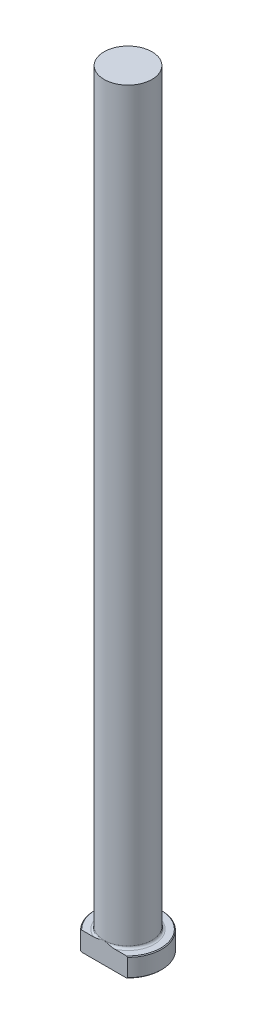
ISO-10303-21;
HEADER;
FILE_DESCRIPTION(('STEP AP214'),'2;1');
FILE_NAME('part.step','',(''),(''),'','','');
FILE_SCHEMA(('AUTOMOTIVE_DESIGN { 1 0 10303 214 1 1 1 1 }'));
ENDSEC;
DATA;
#1=APPLICATION_CONTEXT('core data for automotive mechanical design processes');
#2=APPLICATION_PROTOCOL_DEFINITION('international standard','automotive_design',2000,#1);
#3=PRODUCT_CONTEXT('',#1,'mechanical');
#4=PRODUCT('Part','Part','',(#3));
#5=PRODUCT_RELATED_PRODUCT_CATEGORY('part','',(#4));
#6=PRODUCT_DEFINITION_FORMATION('','',#4);
#7=PRODUCT_DEFINITION_CONTEXT('part definition',#1,'design');
#8=PRODUCT_DEFINITION('design','',#6,#7);
#9=PRODUCT_DEFINITION_SHAPE('','',#8);
#10=(LENGTH_UNIT() NAMED_UNIT(*) SI_UNIT(.MILLI.,.METRE.));
#11=(NAMED_UNIT(*) PLANE_ANGLE_UNIT() SI_UNIT($,.RADIAN.));
#12=(NAMED_UNIT(*) SI_UNIT($,.STERADIAN.) SOLID_ANGLE_UNIT());
#13=UNCERTAINTY_MEASURE_WITH_UNIT(LENGTH_MEASURE(1.E-05),#10,'distance_accuracy_value','');
#14=(GEOMETRIC_REPRESENTATION_CONTEXT(3) GLOBAL_UNCERTAINTY_ASSIGNED_CONTEXT((#13)) GLOBAL_UNIT_ASSIGNED_CONTEXT((#10,
#11,#12)) REPRESENTATION_CONTEXT('',''));
#15=CARTESIAN_POINT('',(0.,0.,0.));
#16=DIRECTION('',(0.,0.,1.));
#17=DIRECTION('',(1.,0.,0.));
#18=AXIS2_PLACEMENT_3D('',#15,#16,#17);
#19=CARTESIAN_POINT('',(0.,0.,0.));
#20=DIRECTION('',(0.,-1.,0.));
#21=DIRECTION('',(0.,0.,-1.));
#22=AXIS2_PLACEMENT_3D('',#19,#20,#21);
#23=PLANE('',#22);
#24=DIRECTION('',(1.,0.,0.));
#25=VECTOR('',#24,1.);
#26=CARTESIAN_POINT('',(-7.77712993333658,0.,7.93749999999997));
#27=LINE('',#26,#25);
#28=CARTESIAN_POINT('',(-7.40966369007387,0.,7.93749999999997));
#29=VERTEX_POINT('',#28);
#30=CARTESIAN_POINT('',(7.40966369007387,0.,7.93749999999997));
#31=VERTEX_POINT('',#30);
#32=EDGE_CURVE('E92',#29,#31,#27,.T.);
#33=ORIENTED_EDGE('',*,*,#32,.F.);
#34=CARTESIAN_POINT('',(0.,0.,0.));
#35=DIRECTION('',(0.,-1.,0.));
#36=DIRECTION('',(0.,0.,-1.));
#37=AXIS2_PLACEMENT_3D('',#34,#35,#36);
#38=CIRCLE('',#37,10.8584999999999);
#39=EDGE_CURVE('E105',#29,#31,#38,.T.);
#40=ORIENTED_EDGE('',*,*,#39,.T.);
#41=EDGE_LOOP('',(#33,#40));
#42=FACE_BOUND('',#41,.T.);
#43=ADVANCED_FACE('F37',(#42),#23,.T.);
#44=CARTESIAN_POINT('',(0.,259.958771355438,0.));
#45=DIRECTION('',(0.,1.,0.));
#46=DIRECTION('',(0.,0.,1.));
#47=AXIS2_PLACEMENT_3D('',#44,#45,#46);
#48=CYLINDRICAL_SURFACE('',#47,11.1125);
#49=DIRECTION('',(0.,-1.,0.));
#50=VECTOR('',#49,1.);
#51=CARTESIAN_POINT('',(-7.77712993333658,254.,7.93749999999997));
#52=LINE('',#51,#50);
#53=CARTESIAN_POINT('',(-7.77712993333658,6.09599999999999,7.93749999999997));
#54=VERTEX_POINT('',#53);
#55=CARTESIAN_POINT('',(-7.77712993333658,0.254000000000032,7.93749999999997));
#56=VERTEX_POINT('',#55);
#57=EDGE_CURVE('E95',#54,#56,#52,.T.);
#58=ORIENTED_EDGE('',*,*,#57,.F.);
#59=CARTESIAN_POINT('',(0.,6.09599999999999,0.));
#60=DIRECTION('',(0.,1.,0.));
#61=DIRECTION('',(0.,0.,1.));
#62=AXIS2_PLACEMENT_3D('',#59,#60,#61);
#63=CIRCLE('',#62,11.1125);
#64=CARTESIAN_POINT('',(7.77712993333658,6.09599999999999,7.93749999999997));
#65=VERTEX_POINT('',#64);
#66=EDGE_CURVE('E109',#54,#65,#63,.F.);
#67=ORIENTED_EDGE('',*,*,#66,.T.);
#68=DIRECTION('',(0.,-1.,0.));
#69=VECTOR('',#68,1.);
#70=CARTESIAN_POINT('',(7.77712993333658,254.,7.93749999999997));
#71=LINE('',#70,#69);
#72=CARTESIAN_POINT('',(7.77712993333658,0.254000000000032,7.93749999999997));
#73=VERTEX_POINT('',#72);
#74=EDGE_CURVE('E187',#65,#73,#71,.T.);
#75=ORIENTED_EDGE('',*,*,#74,.T.);
#76=CARTESIAN_POINT('',(0.,0.254000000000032,0.));
#77=DIRECTION('',(0.,-1.,0.));
#78=DIRECTION('',(0.,0.,-1.));
#79=AXIS2_PLACEMENT_3D('',#76,#77,#78);
#80=CIRCLE('',#79,11.1125);
#81=EDGE_CURVE('E115',#73,#56,#80,.F.);
#82=ORIENTED_EDGE('',*,*,#81,.T.);
#83=EDGE_LOOP('',(#58,#67,#75,#82));
#84=FACE_BOUND('',#83,.T.);
#85=ADVANCED_FACE('F160',(#84),#48,.T.);
#86=CARTESIAN_POINT('',(-11.1125,6.35,0.));
#87=DIRECTION('',(0.,1.,0.));
#88=DIRECTION('',(0.,0.,1.));
#89=AXIS2_PLACEMENT_3D('',#86,#87,#88);
#90=PLANE('',#89);
#91=DIRECTION('',(-1.,0.,0.));
#92=VECTOR('',#91,1.);
#93=CARTESIAN_POINT('',(-11.1125,6.35,7.93749999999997));
#94=LINE('',#93,#92);
#95=CARTESIAN_POINT('',(7.40966369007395,6.35,7.93749999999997));
#96=VERTEX_POINT('',#95);
#97=CARTESIAN_POINT('',(3.56053282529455,6.35,7.93749999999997));
#98=VERTEX_POINT('',#97);
#99=EDGE_CURVE('E58',#96,#98,#94,.T.);
#100=ORIENTED_EDGE('',*,*,#99,.F.);
#101=CARTESIAN_POINT('',(0.,6.35,0.));
#102=DIRECTION('',(0.,1.,0.));
#103=DIRECTION('',(0.,0.,1.));
#104=AXIS2_PLACEMENT_3D('',#101,#102,#103);
#105=CIRCLE('',#104,10.8585);
#106=CARTESIAN_POINT('',(-7.40966369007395,6.35,7.93749999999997));
#107=VERTEX_POINT('',#106);
#108=EDGE_CURVE('E182',#96,#107,#105,.T.);
#109=ORIENTED_EDGE('',*,*,#108,.T.);
#110=CARTESIAN_POINT('',(-3.56053282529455,6.35000000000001,7.93749999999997));
#111=VERTEX_POINT('',#110);
#112=EDGE_CURVE('E140',#111,#107,#94,.T.);
#113=ORIENTED_EDGE('',*,*,#112,.F.);
#114=CARTESIAN_POINT('',(0.,6.35,0.));
#115=DIRECTION('',(0.,1.,0.));
#116=DIRECTION('',(0.,0.,1.));
#117=AXIS2_PLACEMENT_3D('',#114,#115,#116);
#118=CIRCLE('',#117,8.69949999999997);
#119=EDGE_CURVE('E112',#111,#98,#118,.F.);
#120=ORIENTED_EDGE('',*,*,#119,.T.);
#121=EDGE_LOOP('',(#100,#109,#113,#120));
#122=FACE_BOUND('',#121,.T.);
#123=ADVANCED_FACE('F164',(#122),#90,.T.);
#124=CARTESIAN_POINT('',(0.,259.958771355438,0.));
#125=DIRECTION('',(0.,1.,0.));
#126=DIRECTION('',(0.,0.,1.));
#127=AXIS2_PLACEMENT_3D('',#124,#125,#126);
#128=CYLINDRICAL_SURFACE('',#127,7.93749999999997);
#129=CARTESIAN_POINT('',(0.,7.11200000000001,0.));
#130=DIRECTION('',(0.,1.,0.));
#131=DIRECTION('',(0.,0.,1.));
#132=AXIS2_PLACEMENT_3D('',#129,#130,#131);
#133=CIRCLE('',#132,7.93749999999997);
#134=CARTESIAN_POINT('',(0.,7.11200000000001,7.93749999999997));
#135=VERTEX_POINT('',#134);
#136=EDGE_CURVE('E108',#135,#135,#133,.T.);
#137=ORIENTED_EDGE('',*,*,#136,.T.);
#138=EDGE_LOOP('',(#137));
#139=FACE_BOUND('',#138,.T.);
#140=CARTESIAN_POINT('',(0.,254.,0.));
#141=DIRECTION('',(0.,1.,0.));
#142=DIRECTION('',(0.,0.,1.));
#143=AXIS2_PLACEMENT_3D('',#140,#141,#142);
#144=CIRCLE('',#143,7.93749999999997);
#145=CARTESIAN_POINT('',(0.,254.,7.93749999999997));
#146=VERTEX_POINT('',#145);
#147=EDGE_CURVE('E100',#146,#146,#144,.T.);
#148=ORIENTED_EDGE('',*,*,#147,.F.);
#149=EDGE_LOOP('',(#148));
#150=FACE_BOUND('',#149,.T.);
#151=ADVANCED_FACE('F169',(#139,#150),#128,.T.);
#152=CARTESIAN_POINT('',(-7.93749999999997,254.,0.));
#153=DIRECTION('',(0.,1.,0.));
#154=DIRECTION('',(0.,0.,1.));
#155=AXIS2_PLACEMENT_3D('',#152,#153,#154);
#156=PLANE('',#155);
#157=ORIENTED_EDGE('',*,*,#147,.T.);
#158=EDGE_LOOP('',(#157));
#159=FACE_BOUND('',#158,.T.);
#160=ADVANCED_FACE('F127',(#159),#156,.T.);
#161=CARTESIAN_POINT('',(0.,6.35000000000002,0.));
#162=DIRECTION('',(0.,-1.,0.));
#163=DIRECTION('',(0.,0.,-1.));
#164=AXIS2_PLACEMENT_3D('',#161,#162,#163);
#165=CONICAL_SURFACE('',#164,10.8585,0.78539816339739);
#166=CARTESIAN_POINT('',(7.77782993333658,6.09551009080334,7.93749999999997));
#167=CARTESIAN_POINT('',(7.55686416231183,6.25010918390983,7.93749999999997));
#168=CARTESIAN_POINT('',(7.33434137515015,6.40253625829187,7.93749999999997));
#169=CARTESIAN_POINT('',(6.88555157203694,6.70200306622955,7.93749999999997));
#170=CARTESIAN_POINT('',(6.6592828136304,6.84904018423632,7.93749999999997));
#171=CARTESIAN_POINT('',(6.19963219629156,7.13839015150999,7.93749999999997));
#172=CARTESIAN_POINT('',(5.9661962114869,7.28061745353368,7.93749999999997));
#173=CARTESIAN_POINT('',(5.4944634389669,7.55674147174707,7.93749999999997));
#174=CARTESIAN_POINT('',(5.25616724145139,7.69063919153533,7.93749999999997));
#175=CARTESIAN_POINT('',(4.76752037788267,7.95164622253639,7.93749999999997));
#176=CARTESIAN_POINT('',(4.51701802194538,8.07847357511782,7.93749999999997));
#177=CARTESIAN_POINT('',(4.00950327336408,8.31861548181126,7.93749999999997));
#178=CARTESIAN_POINT('',(3.75248967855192,8.43192751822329,7.93749999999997));
#179=CARTESIAN_POINT('',(3.23293213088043,8.64114728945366,7.93749999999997));
#180=CARTESIAN_POINT('',(2.97042338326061,8.73714146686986,7.93749999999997));
#181=CARTESIAN_POINT('',(2.43885877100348,8.90857479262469,7.93749999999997));
#182=CARTESIAN_POINT('',(2.16980716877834,8.9840269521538,7.93749999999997));
#183=CARTESIAN_POINT('',(1.63948909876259,9.10734340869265,7.93749999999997));
#184=CARTESIAN_POINT('',(1.37850272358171,9.15639501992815,7.93749999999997));
#185=CARTESIAN_POINT('',(0.852916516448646,9.2295458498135,7.93749999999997));
#186=CARTESIAN_POINT('',(0.588315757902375,9.25363854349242,7.93749999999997));
#187=CARTESIAN_POINT('',(0.0615241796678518,9.27506688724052,7.93749999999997));
#188=CARTESIAN_POINT('',(-0.200652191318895,9.27275242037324,7.93749999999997));
#189=CARTESIAN_POINT('',(-0.723483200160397,9.24237186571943,7.93749999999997));
#190=CARTESIAN_POINT('',(-0.984137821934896,9.21430550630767,7.93749999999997));
#191=CARTESIAN_POINT('',(-1.49971239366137,9.13455414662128,7.93749999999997));
#192=CARTESIAN_POINT('',(-1.75466085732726,9.08305007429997,7.93749999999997));
#193=CARTESIAN_POINT('',(-2.25943125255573,8.95931831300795,7.93749999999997));
#194=CARTESIAN_POINT('',(-2.50925257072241,8.88708815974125,7.93749999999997));
#195=CARTESIAN_POINT('',(-3.00607435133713,8.7241257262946,7.93749999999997));
#196=CARTESIAN_POINT('',(-3.25300380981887,8.63317958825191,7.93749999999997));
#197=CARTESIAN_POINT('',(-3.74082952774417,8.43650564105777,7.93749999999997));
#198=CARTESIAN_POINT('',(-3.98172592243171,8.33077816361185,7.93749999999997));
#199=CARTESIAN_POINT('',(-4.53707594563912,8.07009959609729,7.93749999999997));
#200=CARTESIAN_POINT('',(-4.849326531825,7.9104773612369,7.93749999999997));
#201=CARTESIAN_POINT('',(-5.4650687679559,7.57500459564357,7.93749999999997));
#202=CARTESIAN_POINT('',(-5.76855592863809,7.39914593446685,7.93749999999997));
#203=CARTESIAN_POINT('',(-6.35980673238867,7.04004732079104,7.93749999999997));
#204=CARTESIAN_POINT('',(-6.64777344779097,6.85713981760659,7.93749999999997));
#205=CARTESIAN_POINT('',(-7.07499889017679,6.57609320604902,7.93749999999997));
#206=CARTESIAN_POINT('',(-7.21652251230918,6.48136542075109,7.93749999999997));
#207=CARTESIAN_POINT('',(-7.49818193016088,6.2898924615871,7.93749999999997));
#208=CARTESIAN_POINT('',(-7.6383178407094,6.19314745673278,7.93749999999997));
#209=CARTESIAN_POINT('',(-7.77782993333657,6.09551009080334,7.93749999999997));
#210=B_SPLINE_CURVE_WITH_KNOTS('',3,(#166,#167,#168,#169,#170,#171,#172,#173,#174,#175,#176,
#177,#178,#179,#180,#181,#182,#183,#184,#185,#186,#187,#188,#189,#190,#191,#192,#193,#194,#195,
#196,#197,#198,#199,#200,#201,#202,#203,#204,#205,#206,#207,#208,#209),.UNSPECIFIED.,.F.,.F.,(4,
2,2,2,2,2,2,2,2,2,2,2,2,2,2,2,2,2,2,2,2,4),(0.,0.809069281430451,1.61852611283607,
2.43843783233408,3.25825057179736,4.10026020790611,4.94242645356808,5.78026509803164,
6.61757181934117,7.41315717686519,8.20895047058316,8.99421223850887,9.77948228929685,
10.5587906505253,11.3381917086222,12.1270494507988,12.9158894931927,13.9672755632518,
15.0191910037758,16.0423969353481,16.55328513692,17.0641307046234),.UNSPECIFIED.);
#211=EDGE_CURVE('E63',#65,#96,#210,.T.);
#212=ORIENTED_EDGE('',*,*,#211,.F.);
#213=ORIENTED_EDGE('',*,*,#66,.F.);
#214=EDGE_CURVE('E133',#107,#54,#210,.T.);
#215=ORIENTED_EDGE('',*,*,#214,.F.);
#216=ORIENTED_EDGE('',*,*,#108,.F.);
#217=EDGE_LOOP('',(#212,#213,#215,#216));
#218=FACE_BOUND('',#217,.T.);
#219=ADVANCED_FACE('F147',(#218),#165,.T.);
#220=CARTESIAN_POINT('',(0.,0.254000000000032,0.));
#221=DIRECTION('',(0.,1.,0.));
#222=DIRECTION('',(0.,0.,1.));
#223=AXIS2_PLACEMENT_3D('',#220,#221,#222);
#224=CONICAL_SURFACE('',#223,11.1125,0.785398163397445);
#225=CARTESIAN_POINT('',(-7.77782993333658,0.254489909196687,7.93749999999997));
#226=CARTESIAN_POINT('',(-7.55686416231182,0.099890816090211,7.93749999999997));
#227=CARTESIAN_POINT('',(-7.33434137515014,-0.052536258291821,7.93749999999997));
#228=CARTESIAN_POINT('',(-6.88555157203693,-0.352003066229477,7.93749999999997));
#229=CARTESIAN_POINT('',(-6.65928281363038,-0.499040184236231,7.93749999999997));
#230=CARTESIAN_POINT('',(-6.19963219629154,-0.788390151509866,7.93749999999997));
#231=CARTESIAN_POINT('',(-5.96619621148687,-0.93061745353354,7.93749999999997));
#232=CARTESIAN_POINT('',(-5.49446343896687,-1.20674147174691,7.93749999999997));
#233=CARTESIAN_POINT('',(-5.25616724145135,-1.34063919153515,7.93749999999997));
#234=CARTESIAN_POINT('',(-4.76752037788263,-1.60164622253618,7.93749999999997));
#235=CARTESIAN_POINT('',(-4.51701802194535,-1.7284735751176,7.93749999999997));
#236=CARTESIAN_POINT('',(-4.00950327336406,-1.96861548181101,7.93749999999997));
#237=CARTESIAN_POINT('',(-3.7524896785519,-2.08192751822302,7.93749999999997));
#238=CARTESIAN_POINT('',(-3.23293213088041,-2.29114728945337,7.93749999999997));
#239=CARTESIAN_POINT('',(-2.9704233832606,-2.38714146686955,7.93749999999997));
#240=CARTESIAN_POINT('',(-2.43885877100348,-2.55857479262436,7.93749999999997));
#241=CARTESIAN_POINT('',(-2.16980716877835,-2.63402695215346,7.93749999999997));
#242=CARTESIAN_POINT('',(-1.63948909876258,-2.7573434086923,7.93749999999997));
#243=CARTESIAN_POINT('',(-1.37850272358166,-2.8063950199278,7.93749999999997));
#244=CARTESIAN_POINT('',(-0.852916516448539,-2.87954584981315,7.93749999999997));
#245=CARTESIAN_POINT('',(-0.588315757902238,-2.90363854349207,7.93749999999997));
#246=CARTESIAN_POINT('',(-0.061524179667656,-2.92506688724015,7.93749999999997));
#247=CARTESIAN_POINT('',(0.20065219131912,-2.92275242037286,7.93749999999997));
#248=CARTESIAN_POINT('',(0.72348320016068,-2.89237186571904,7.93749999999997));
#249=CARTESIAN_POINT('',(0.984137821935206,-2.86430550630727,7.93749999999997));
#250=CARTESIAN_POINT('',(1.49971239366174,-2.78455414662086,7.93749999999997));
#251=CARTESIAN_POINT('',(1.75466085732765,-2.73305007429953,7.93749999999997));
#252=CARTESIAN_POINT('',(2.25943125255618,-2.60931831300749,7.93749999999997));
#253=CARTESIAN_POINT('',(2.50925257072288,-2.53708815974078,7.93749999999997));
#254=CARTESIAN_POINT('',(3.00607435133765,-2.37412572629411,7.93749999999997));
#255=CARTESIAN_POINT('',(3.25300380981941,-2.2831795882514,7.93749999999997));
#256=CARTESIAN_POINT('',(3.74082952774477,-2.08650564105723,7.93749999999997));
#257=CARTESIAN_POINT('',(3.98172592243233,-1.98077816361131,7.93749999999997));
#258=CARTESIAN_POINT('',(4.53707594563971,-1.72009959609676,7.93749999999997));
#259=CARTESIAN_POINT('',(4.84932653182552,-1.5604773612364,7.93749999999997));
#260=CARTESIAN_POINT('',(5.4650687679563,-1.22500459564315,7.93749999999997));
#261=CARTESIAN_POINT('',(5.76855592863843,-1.04914593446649,7.93749999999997));
#262=CARTESIAN_POINT('',(6.35980673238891,-0.690047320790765,7.93749999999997));
#263=CARTESIAN_POINT('',(6.64777344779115,-0.507139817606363,7.93749999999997));
#264=CARTESIAN_POINT('',(7.0749988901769,-0.226093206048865,7.93749999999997));
#265=CARTESIAN_POINT('',(7.21652251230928,-0.13136542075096,7.93749999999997));
#266=CARTESIAN_POINT('',(7.49818193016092,0.0601075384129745,7.93749999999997));
#267=CARTESIAN_POINT('',(7.63831784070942,0.156852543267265,7.93749999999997));
#268=CARTESIAN_POINT('',(7.77782993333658,0.254489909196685,7.93749999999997));
#269=B_SPLINE_CURVE_WITH_KNOTS('',3,(#225,#226,#227,#228,#229,#230,#231,#232,#233,#234,#235,
#236,#237,#238,#239,#240,#241,#242,#243,#244,#245,#246,#247,#248,#249,#250,#251,#252,#253,#254,
#255,#256,#257,#258,#259,#260,#261,#262,#263,#264,#265,#266,#267,#268),.UNSPECIFIED.,.F.,.F.,(4,
2,2,2,2,2,2,2,2,2,2,2,2,2,2,2,2,2,2,2,2,4),(0.,0.809069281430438,1.61852611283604,
2.43843783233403,3.2582505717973,4.10026020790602,4.94242645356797,5.7802650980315,
6.61757181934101,7.41315717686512,8.20895047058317,8.99421223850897,9.77948228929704,
10.5587906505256,11.3381917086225,12.1270494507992,12.9158894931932,13.9672755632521,
15.0191910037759,16.042396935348,16.5532851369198,17.0641307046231),.UNSPECIFIED.);
#270=EDGE_CURVE('E89',#56,#29,#269,.T.);
#271=ORIENTED_EDGE('',*,*,#270,.F.);
#272=ORIENTED_EDGE('',*,*,#81,.F.);
#273=EDGE_CURVE('E101',#31,#73,#269,.T.);
#274=ORIENTED_EDGE('',*,*,#273,.F.);
#275=ORIENTED_EDGE('',*,*,#39,.F.);
#276=EDGE_LOOP('',(#271,#272,#274,#275));
#277=FACE_BOUND('',#276,.T.);
#278=ADVANCED_FACE('F107',(#277),#224,.T.);
#279=CARTESIAN_POINT('',(0.,7.11200000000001,0.));
#280=DIRECTION('',(0.,1.,0.));
#281=DIRECTION('',(0.,0.,1.));
#282=AXIS2_PLACEMENT_3D('',#279,#280,#281);
#283=TOROIDAL_SURFACE('',#282,8.69949999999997,0.762);
#284=ORIENTED_EDGE('',*,*,#119,.F.);
#285=CARTESIAN_POINT('',(0.,7.11200000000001,7.93749999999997));
#286=CARTESIAN_POINT('',(1.13258152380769E-10,7.11200098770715,7.93749999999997));
#287=CARTESIAN_POINT('',(-2.94116963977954E-07,7.11200197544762,7.93749999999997));
#288=CARTESIAN_POINT('',(-1.16076455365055E-06,7.11200384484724,7.93749999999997));
#289=CARTESIAN_POINT('',(-1.74846185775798E-06,7.11200471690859,7.93749999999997));
#290=CARTESIAN_POINT('',(-3.15168242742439E-06,7.11200648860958,7.93749999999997));
#291=CARTESIAN_POINT('',(-3.98838294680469E-06,7.11200737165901,7.93749999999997));
#292=CARTESIAN_POINT('',(-5.75414916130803E-06,7.11200899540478,7.93749999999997));
#293=CARTESIAN_POINT('',(-6.68112169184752E-06,7.11200973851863,7.93749999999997));
#294=CARTESIAN_POINT('',(-1.01485822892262E-05,7.11201237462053,7.93749999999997));
#295=CARTESIAN_POINT('',(-1.28042082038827E-05,7.11201412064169,7.93749999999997));
#296=CARTESIAN_POINT('',(-1.81630822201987E-05,7.11201710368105,7.93749999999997));
#297=CARTESIAN_POINT('',(-2.08532201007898E-05,7.1120183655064,7.93749999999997));
#298=CARTESIAN_POINT('',(-3.18657482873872E-05,7.1120234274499,7.93749999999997));
#299=CARTESIAN_POINT('',(-4.02765822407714E-05,7.11202705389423,7.93749999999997));
#300=CARTESIAN_POINT('',(-5.64375980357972E-05,7.11203261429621,7.93749999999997));
#301=CARTESIAN_POINT('',(-6.41339918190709E-05,7.1120347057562,7.93749999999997));
#302=CARTESIAN_POINT('',(-0.000120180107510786,7.11204956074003,7.93749999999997));
#303=CARTESIAN_POINT('',(-0.000168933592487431,7.11206045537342,7.93749999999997));
#304=CARTESIAN_POINT('',(-0.000360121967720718,7.11210809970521,7.93749999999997));
#305=CARTESIAN_POINT('',(-0.000500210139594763,7.11215390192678,7.93749999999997));
#306=CARTESIAN_POINT('',(-0.00105170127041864,7.11233078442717,7.93749999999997));
#307=CARTESIAN_POINT('',(-0.00146451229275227,7.11245570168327,7.93749999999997));
#308=CARTESIAN_POINT('',(-0.00309439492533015,7.1129530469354,7.93749999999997));
#309=CARTESIAN_POINT('',(-0.00430970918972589,7.11333301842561,7.93749999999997));
#310=CARTESIAN_POINT('',(-0.00935535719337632,7.11490592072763,7.93749999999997));
#311=CARTESIAN_POINT('',(-0.0131878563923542,7.11608956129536,7.93749999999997));
#312=CARTESIAN_POINT('',(-0.0841146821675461,7.13800088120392,7.93749999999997));
#313=CARTESIAN_POINT('',(-0.151187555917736,7.15882206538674,7.93749999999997));
#314=CARTESIAN_POINT('',(-0.282710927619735,7.1994724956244,7.93749999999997));
#315=CARTESIAN_POINT('',(-0.347159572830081,7.2193082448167,7.93749999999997));
#316=CARTESIAN_POINT('',(-0.484183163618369,7.26126494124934,7.93749999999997));
#317=CARTESIAN_POINT('',(-0.556765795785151,7.28336123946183,7.93749999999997));
#318=CARTESIAN_POINT('',(-0.702843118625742,7.32740310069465,7.93749999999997));
#319=CARTESIAN_POINT('',(-0.77633910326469,7.34934437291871,7.93749999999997));
#320=CARTESIAN_POINT('',(-0.902891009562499,7.38662160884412,7.93749999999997));
#321=CARTESIAN_POINT('',(-0.955908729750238,7.40208704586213,7.93749999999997));
#322=CARTESIAN_POINT('',(-1.06190505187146,7.4326430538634,7.93749999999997));
#323=CARTESIAN_POINT('',(-1.1148834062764,7.44773448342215,7.93749999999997));
#324=CARTESIAN_POINT('',(-1.27145845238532,7.49171323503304,7.93749999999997));
#325=CARTESIAN_POINT('',(-1.37521028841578,7.52005117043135,7.93749999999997));
#326=CARTESIAN_POINT('',(-1.61238875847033,7.58245782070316,7.93749999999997));
#327=CARTESIAN_POINT('',(-1.74598056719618,7.61590602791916,7.93749999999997));
#328=CARTESIAN_POINT('',(-2.01520265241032,7.67878699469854,7.93749999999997));
#329=CARTESIAN_POINT('',(-2.15084070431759,7.70818682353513,7.93749999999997));
#330=CARTESIAN_POINT('',(-2.43325292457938,7.76331762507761,7.93749999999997));
#331=CARTESIAN_POINT('',(-2.58011275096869,7.7886200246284,7.93749999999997));
#332=CARTESIAN_POINT('',(-2.87472585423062,7.83067454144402,7.93749999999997));
#333=CARTESIAN_POINT('',(-3.02247613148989,7.84744708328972,7.93749999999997));
#334=CARTESIAN_POINT('',(-3.31060630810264,7.86923610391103,7.93749999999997));
#335=CARTESIAN_POINT('',(-3.45093460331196,7.87485939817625,7.93749999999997));
#336=CARTESIAN_POINT('',(-3.66050189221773,7.87341982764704,7.93749999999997));
#337=CARTESIAN_POINT('',(-3.72977927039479,7.87133675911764,7.93749999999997));
#338=CARTESIAN_POINT('',(-3.86811371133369,7.86341207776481,7.93749999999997));
#339=CARTESIAN_POINT('',(-3.93717083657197,7.85757164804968,7.93749999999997));
#340=CARTESIAN_POINT('',(-4.06041254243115,7.84314460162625,7.93749999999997));
#341=CARTESIAN_POINT('',(-4.11469322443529,7.83538548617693,7.93749999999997));
#342=CARTESIAN_POINT('',(-4.22269673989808,7.81667130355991,7.93749999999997));
#343=CARTESIAN_POINT('',(-4.27641972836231,7.8057171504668,7.93749999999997));
#344=CARTESIAN_POINT('',(-4.38294358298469,7.78009016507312,7.93749999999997));
#345=CARTESIAN_POINT('',(-4.43574509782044,7.76542007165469,7.93749999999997));
#346=CARTESIAN_POINT('',(-4.5399035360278,7.73168797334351,7.93749999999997));
#347=CARTESIAN_POINT('',(-4.59126184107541,7.7126303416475,7.93749999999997));
#348=CARTESIAN_POINT('',(-4.68243097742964,7.67324353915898,7.93749999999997));
#349=CARTESIAN_POINT('',(-4.72262101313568,7.65380111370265,7.93749999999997));
#350=CARTESIAN_POINT('',(-4.80081729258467,7.61075795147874,7.93749999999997));
#351=CARTESIAN_POINT('',(-4.83882094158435,7.5871524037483,7.93749999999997));
#352=CARTESIAN_POINT('',(-4.91185697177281,7.53476777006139,7.93749999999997));
#353=CARTESIAN_POINT('',(-4.94684723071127,7.50592882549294,7.93749999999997));
#354=CARTESIAN_POINT('',(-5.01124850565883,7.44256359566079,7.93749999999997));
#355=CARTESIAN_POINT('',(-5.04068010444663,7.40805921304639,7.93749999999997));
#356=CARTESIAN_POINT('',(-5.08050372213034,7.34868448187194,7.93749999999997));
#357=CARTESIAN_POINT('',(-5.0937376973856,7.32572520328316,7.93749999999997));
#358=CARTESIAN_POINT('',(-5.11643276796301,7.27799728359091,7.93749999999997));
#359=CARTESIAN_POINT('',(-5.12589708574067,7.2532302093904,7.93749999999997));
#360=CARTESIAN_POINT('',(-5.14035194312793,7.20217121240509,7.93749999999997));
#361=CARTESIAN_POINT('',(-5.14530427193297,7.17586823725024,7.93749999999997));
#362=CARTESIAN_POINT('',(-5.15008487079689,7.12280054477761,7.93749999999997));
#363=CARTESIAN_POINT('',(-5.14991589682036,7.096036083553,7.93749999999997));
#364=CARTESIAN_POINT('',(-5.14478044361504,7.04592288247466,7.93749999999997));
#365=CARTESIAN_POINT('',(-5.14033553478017,7.02251814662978,7.93749999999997));
#366=CARTESIAN_POINT('',(-5.12776595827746,6.97672688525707,7.93749999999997));
#367=CARTESIAN_POINT('',(-5.11963963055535,6.95434082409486,7.93749999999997));
#368=CARTESIAN_POINT('',(-5.09700432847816,6.90374425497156,7.93749999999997));
#369=CARTESIAN_POINT('',(-5.08127026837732,6.87608398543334,7.93749999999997));
#370=CARTESIAN_POINT('',(-5.04556418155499,6.82365182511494,7.93749999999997));
#371=CARTESIAN_POINT('',(-5.02558286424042,6.79888645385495,7.93749999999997));
#372=CARTESIAN_POINT('',(-4.97125379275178,6.74000253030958,7.93749999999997));
#373=CARTESIAN_POINT('',(-4.93486414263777,6.70778219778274,7.93749999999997));
#374=CARTESIAN_POINT('',(-4.85771872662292,6.64922291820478,7.93749999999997));
#375=CARTESIAN_POINT('',(-4.81695725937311,6.62289179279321,7.93749999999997));
#376=CARTESIAN_POINT('',(-4.73720517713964,6.57773800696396,7.93749999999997));
#377=CARTESIAN_POINT('',(-4.69849365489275,6.5584128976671,7.93749999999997));
#378=CARTESIAN_POINT('',(-4.61954917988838,6.5231323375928,7.93749999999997));
#379=CARTESIAN_POINT('',(-4.57931497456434,6.50717973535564,7.93749999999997));
#380=CARTESIAN_POINT('',(-4.45647143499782,6.46345758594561,7.93749999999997));
#381=CARTESIAN_POINT('',(-4.37228494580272,6.44011987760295,7.93749999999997));
#382=CARTESIAN_POINT('',(-4.19880968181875,6.4017233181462,7.93749999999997));
#383=CARTESIAN_POINT('',(-4.10944883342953,6.38701466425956,7.93749999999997));
#384=CARTESIAN_POINT('',(-3.92966045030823,6.36518873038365,7.93749999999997));
#385=CARTESIAN_POINT('',(-3.83923113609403,6.35808673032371,7.93749999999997));
#386=CARTESIAN_POINT('',(-3.66108493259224,6.35019088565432,7.93749999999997));
#387=CARTESIAN_POINT('',(-3.57337577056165,6.34919885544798,7.93749999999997));
#388=CARTESIAN_POINT('',(-3.39842026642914,6.35200478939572,7.93749999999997));
#389=CARTESIAN_POINT('',(-3.31117353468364,6.35578253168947,7.93749999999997));
#390=CARTESIAN_POINT('',(-3.10624349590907,6.36936667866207,7.93749999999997));
#391=CARTESIAN_POINT('',(-2.98867206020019,6.38082875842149,7.93749999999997));
#392=CARTESIAN_POINT('',(-2.75430549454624,6.40959217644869,7.93749999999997));
#393=CARTESIAN_POINT('',(-2.63751016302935,6.42689193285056,7.93749999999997));
#394=CARTESIAN_POINT('',(-2.40203457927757,6.46665897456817,7.93749999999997));
#395=CARTESIAN_POINT('',(-2.28337321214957,6.48923652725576,7.93749999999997));
#396=CARTESIAN_POINT('',(-2.0465823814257,6.53840461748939,7.93749999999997));
#397=CARTESIAN_POINT('',(-1.92845502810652,6.5650051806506,7.93749999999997));
#398=CARTESIAN_POINT('',(-1.6507512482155,6.63144067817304,7.93749999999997));
#399=CARTESIAN_POINT('',(-1.49149431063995,6.67260177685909,7.93749999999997));
#400=CARTESIAN_POINT('',(-1.17583354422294,6.75847009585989,7.93749999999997));
#401=CARTESIAN_POINT('',(-1.01941758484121,6.80313344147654,7.93749999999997));
#402=CARTESIAN_POINT('',(-0.794236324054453,6.86935337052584,7.93749999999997));
#403=CARTESIAN_POINT('',(-0.725177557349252,6.88992364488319,7.93749999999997));
#404=CARTESIAN_POINT('',(-0.586877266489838,6.93151983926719,7.93749999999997));
#405=CARTESIAN_POINT('',(-0.517636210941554,6.95254732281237,7.93749999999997));
#406=CARTESIAN_POINT('',(-0.375904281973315,6.99585156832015,7.93749999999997));
#407=CARTESIAN_POINT('',(-0.303416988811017,7.01813983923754,7.93749999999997));
#408=CARTESIAN_POINT('',(-0.159634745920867,7.06256277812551,7.93749999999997));
#409=CARTESIAN_POINT('',(-0.0883389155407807,7.08469437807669,7.93749999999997));
#410=CARTESIAN_POINT('',(-0.0131844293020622,7.10791148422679,7.93749999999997));
#411=CARTESIAN_POINT('',(-0.00934850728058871,7.10909618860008,7.93749999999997));
#412=CARTESIAN_POINT('',(-0.00430206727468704,7.11066934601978,7.93749999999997));
#413=CARTESIAN_POINT('',(-0.0030893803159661,7.1110484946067,7.93749999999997));
#414=CARTESIAN_POINT('',(-0.00146278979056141,7.11154483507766,7.93749999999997));
#415=CARTESIAN_POINT('',(-0.00105063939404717,7.11166955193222,7.93749999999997));
#416=CARTESIAN_POINT('',(-0.000499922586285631,7.11184619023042,7.93749999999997));
#417=CARTESIAN_POINT('',(-0.000359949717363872,7.11189195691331,7.93749999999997));
#418=CARTESIAN_POINT('',(-0.000168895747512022,7.11193956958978,7.93749999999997));
#419=CARTESIAN_POINT('',(-0.000120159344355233,7.11195046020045,7.93749999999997));
#420=CARTESIAN_POINT('',(-6.41304538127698E-05,7.11196530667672,7.93749999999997));
#421=CARTESIAN_POINT('',(-5.64350941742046E-05,7.11196739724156,7.93749999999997));
#422=CARTESIAN_POINT('',(-4.02761206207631E-05,7.1119729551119,7.93749999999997));
#423=CARTESIAN_POINT('',(-3.18662417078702E-05,7.11197657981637,7.93749999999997));
#424=CARTESIAN_POINT('',(-2.08546748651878E-05,7.111981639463,7.93749999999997));
#425=CARTESIAN_POINT('',(-1.81646141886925E-05,7.11198290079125,7.93749999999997));
#426=CARTESIAN_POINT('',(-1.28058054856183E-05,7.11198588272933,7.93749999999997));
#427=CARTESIAN_POINT('',(-1.01501596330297E-05,7.11198762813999,7.93749999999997));
#428=CARTESIAN_POINT('',(-6.68256608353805E-06,7.1119902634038,7.93749999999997));
#429=CARTESIAN_POINT('',(-5.75553210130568E-06,7.11199100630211,7.93749999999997));
#430=CARTESIAN_POINT('',(-3.98960414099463E-06,7.11199262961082,7.93749999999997));
#431=CARTESIAN_POINT('',(-3.15280241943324E-06,7.11199351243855,7.93749999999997));
#432=CARTESIAN_POINT('',(-1.74934054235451E-06,7.11199528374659,7.93749999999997));
#433=CARTESIAN_POINT('',(-1.16151054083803E-06,7.11199615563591,7.93749999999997));
#434=CARTESIAN_POINT('',(-2.9453442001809E-07,7.11199802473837,7.93749999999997));
#435=CARTESIAN_POINT('',(-1.1325131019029E-10,7.11199901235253,7.93749999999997));
#436=CARTESIAN_POINT('',(0.,7.11200000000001,7.93749999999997));
#437=B_SPLINE_CURVE_WITH_KNOTS('',3,(#285,#286,#287,#288,#289,#290,#291,#292,#293,#294,#295,
#296,#297,#298,#299,#300,#301,#302,#303,#304,#305,#306,#307,#308,#309,#310,#311,#312,#313,#314,
#315,#316,#317,#318,#319,#320,#321,#322,#323,#324,#325,#326,#327,#328,#329,#330,#331,#332,#333,
#334,#335,#336,#337,#338,#339,#340,#341,#342,#343,#344,#345,#346,#347,#348,#349,#350,#351,#352,
#353,#354,#355,#356,#357,#358,#359,#360,#361,#362,#363,#364,#365,#366,#367,#368,#369,#370,#371,
#372,#373,#374,#375,#376,#377,#378,#379,#380,#381,#382,#383,#384,#385,#386,#387,#388,#389,#390,
#391,#392,#393,#394,#395,#396,#397,#398,#399,#400,#401,#402,#403,#404,#405,#406,#407,#408,#409,
#410,#411,#412,#413,#414,#415,#416,#417,#418,#419,#420,#421,#422,#423,#424,#425,#426,#427,#428,
#429,#430,#431,#432,#433,#434,#435,#436),.UNSPECIFIED.,.T.,.F.,(4,2,2,2,2,2,2,2,2,2,2,2,2,2,2,2,
2,2,2,2,2,2,2,2,2,2,2,2,2,2,2,2,2,2,2,2,2,2,2,2,2,2,2,2,2,2,2,2,2,2,2,2,2,2,2,2,2,2,2,2,2,2,2,2,
2,2,2,2,2,2,2,2,2,2,2,4),(0.,2.97091136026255E-06,6.11577848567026E-06,9.74697906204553E-06,
1.33081308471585E-05,2.28024387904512E-05,3.17093749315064E-05,5.91235364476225E-05,
8.30186327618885E-05,0.000232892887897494,0.000674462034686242,0.00196893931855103,
0.00578821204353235,0.0178223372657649,0.228503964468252,0.430802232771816,0.658415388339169,
0.888517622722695,1.05419863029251,1.21945534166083,1.54209895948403,1.95519189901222,
2.37146826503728,2.81834547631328,3.26414755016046,3.6849361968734,3.89278379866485,
4.10056598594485,4.26498450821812,4.42935603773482,4.59360676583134,4.75769448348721,
4.89144050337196,5.02534210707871,5.1608847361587,5.29591518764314,5.37514552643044,
5.45430798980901,5.53413479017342,5.61391863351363,5.68506157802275,5.7562366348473,
5.85117093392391,5.94631507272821,6.09131078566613,6.23649794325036,6.36611054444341,
6.49583218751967,6.7571662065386,7.02848031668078,7.30033841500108,7.56332987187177,
7.82521008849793,8.17940150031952,8.53349701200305,8.89578256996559,9.25898631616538,
9.75237330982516,10.2403455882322,10.4565169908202,10.673606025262,10.9011178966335,
11.1250637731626,11.1371086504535,11.1409196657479,11.1422120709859,11.1426532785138,
11.1428031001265,11.1428269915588,11.1428544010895,11.1428633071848,11.142872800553,
11.1428763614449,11.1428799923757,11.1428831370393,11.1428861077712),.UNSPECIFIED.);
#438=EDGE_CURVE('E11',#111,#135,#437,.T.);
#439=ORIENTED_EDGE('',*,*,#438,.T.);
#440=ORIENTED_EDGE('',*,*,#136,.F.);
#441=CARTESIAN_POINT('',(0.,7.11200000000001,7.93749999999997));
#442=CARTESIAN_POINT('',(-1.1325831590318E-10,7.11199901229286,7.93749999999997));
#443=CARTESIAN_POINT('',(2.94116963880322E-07,7.11199802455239,7.93749999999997));
#444=CARTESIAN_POINT('',(1.16076455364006E-06,7.11199615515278,7.93749999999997));
#445=CARTESIAN_POINT('',(1.74846185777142E-06,7.11199528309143,7.93749999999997));
#446=CARTESIAN_POINT('',(3.15168242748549E-06,7.11199351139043,7.93749999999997));
#447=CARTESIAN_POINT('',(3.98838294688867E-06,7.11199262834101,7.93749999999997));
#448=CARTESIAN_POINT('',(5.75414916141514E-06,7.11199100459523,7.93749999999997));
#449=CARTESIAN_POINT('',(6.68112169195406E-06,7.11199026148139,7.93749999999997));
#450=CARTESIAN_POINT('',(1.01485822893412E-05,7.11198762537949,7.93749999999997));
#451=CARTESIAN_POINT('',(1.28042082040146E-05,7.11198587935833,7.93749999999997));
#452=CARTESIAN_POINT('',(1.81630822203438E-05,7.11198289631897,7.93749999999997));
#453=CARTESIAN_POINT('',(2.0853220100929E-05,7.11198163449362,7.93749999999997));
#454=CARTESIAN_POINT('',(3.18657482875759E-05,7.11197657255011,7.93749999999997));
#455=CARTESIAN_POINT('',(4.02765822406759E-05,7.11197294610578,7.93749999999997));
#456=CARTESIAN_POINT('',(5.6437598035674E-05,7.11196738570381,7.93749999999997));
#457=CARTESIAN_POINT('',(6.41339918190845E-05,7.11196529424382,7.93749999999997));
#458=CARTESIAN_POINT('',(0.000120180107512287,7.11195043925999,7.93749999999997));
#459=CARTESIAN_POINT('',(0.000168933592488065,7.1119395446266,7.93749999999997));
#460=CARTESIAN_POINT('',(0.000360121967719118,7.1118919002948,7.93749999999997));
#461=CARTESIAN_POINT('',(0.000500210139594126,7.11184609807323,7.93749999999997));
#462=CARTESIAN_POINT('',(0.00105170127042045,7.11166921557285,7.93749999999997));
#463=CARTESIAN_POINT('',(0.00146451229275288,7.11154429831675,7.93749999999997));
#464=CARTESIAN_POINT('',(0.00309439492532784,7.11104695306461,7.93749999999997));
#465=CARTESIAN_POINT('',(0.00430970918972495,7.1106669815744,7.93749999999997));
#466=CARTESIAN_POINT('',(0.00935535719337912,7.1090940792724,7.93749999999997));
#467=CARTESIAN_POINT('',(0.0131878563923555,7.10791043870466,7.93749999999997));
#468=CARTESIAN_POINT('',(0.0841146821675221,7.08599911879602,7.93749999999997));
#469=CARTESIAN_POINT('',(0.151187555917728,7.06517793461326,7.93749999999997));
#470=CARTESIAN_POINT('',(0.282710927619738,7.02452750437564,7.93749999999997));
#471=CARTESIAN_POINT('',(0.347159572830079,7.00469175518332,7.93749999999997));
#472=CARTESIAN_POINT('',(0.484183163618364,6.96273505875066,7.93749999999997));
#473=CARTESIAN_POINT('',(0.556765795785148,6.94063876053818,7.93749999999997));
#474=CARTESIAN_POINT('',(0.702843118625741,6.89659689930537,7.93749999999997));
#475=CARTESIAN_POINT('',(0.77633910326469,6.87465562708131,7.93749999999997));
#476=CARTESIAN_POINT('',(0.902891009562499,6.8373783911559,7.93749999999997));
#477=CARTESIAN_POINT('',(0.955908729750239,6.82191295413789,7.93749999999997));
#478=CARTESIAN_POINT('',(1.06190505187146,6.79135694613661,7.93749999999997));
#479=CARTESIAN_POINT('',(1.11488340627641,6.77626551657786,7.93749999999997));
#480=CARTESIAN_POINT('',(1.27145845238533,6.73228676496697,7.93749999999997));
#481=CARTESIAN_POINT('',(1.37521028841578,6.70394882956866,7.93749999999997));
#482=CARTESIAN_POINT('',(1.61238875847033,6.64154217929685,7.93749999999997));
#483=CARTESIAN_POINT('',(1.74598056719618,6.60809397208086,7.93749999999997));
#484=CARTESIAN_POINT('',(2.01520265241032,6.54521300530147,7.93749999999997));
#485=CARTESIAN_POINT('',(2.15084070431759,6.51581317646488,7.93749999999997));
#486=CARTESIAN_POINT('',(2.43325292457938,6.46068237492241,7.93749999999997));
#487=CARTESIAN_POINT('',(2.58011275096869,6.43537997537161,7.93749999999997));
#488=CARTESIAN_POINT('',(2.87472585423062,6.393325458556,7.93749999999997));
#489=CARTESIAN_POINT('',(3.02247613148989,6.3765529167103,7.93749999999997));
#490=CARTESIAN_POINT('',(3.31060630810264,6.35476389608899,7.93749999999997));
#491=CARTESIAN_POINT('',(3.45093460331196,6.34914060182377,7.93749999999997));
#492=CARTESIAN_POINT('',(3.66050189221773,6.35058017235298,7.93749999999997));
#493=CARTESIAN_POINT('',(3.72977927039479,6.35266324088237,7.93749999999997));
#494=CARTESIAN_POINT('',(3.86811371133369,6.36058792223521,7.93749999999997));
#495=CARTESIAN_POINT('',(3.93717083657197,6.36642835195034,7.93749999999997));
#496=CARTESIAN_POINT('',(4.06041254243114,6.38085539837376,7.93749999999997));
#497=CARTESIAN_POINT('',(4.11469322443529,6.38861451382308,7.93749999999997));
#498=CARTESIAN_POINT('',(4.22269673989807,6.40732869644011,7.93749999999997));
#499=CARTESIAN_POINT('',(4.27641972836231,6.41828284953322,7.93749999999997));
#500=CARTESIAN_POINT('',(4.38294358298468,6.44390983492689,7.93749999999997));
#501=CARTESIAN_POINT('',(4.43574509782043,6.45857992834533,7.93749999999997));
#502=CARTESIAN_POINT('',(4.5399035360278,6.4923120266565,7.93749999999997));
#503=CARTESIAN_POINT('',(4.59126184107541,6.51136965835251,7.93749999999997));
#504=CARTESIAN_POINT('',(4.68243097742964,6.55075646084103,7.93749999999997));
#505=CARTESIAN_POINT('',(4.72262101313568,6.57019888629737,7.93749999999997));
#506=CARTESIAN_POINT('',(4.80081729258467,6.61324204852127,7.93749999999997));
#507=CARTESIAN_POINT('',(4.83882094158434,6.63684759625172,7.93749999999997));
#508=CARTESIAN_POINT('',(4.91185697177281,6.68923222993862,7.93749999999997));
#509=CARTESIAN_POINT('',(4.94684723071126,6.71807117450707,7.93749999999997));
#510=CARTESIAN_POINT('',(5.01124850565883,6.78143640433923,7.93749999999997));
#511=CARTESIAN_POINT('',(5.04068010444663,6.81594078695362,7.93749999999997));
#512=CARTESIAN_POINT('',(5.08050372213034,6.87531551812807,7.93749999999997));
#513=CARTESIAN_POINT('',(5.09373769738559,6.89827479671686,7.93749999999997));
#514=CARTESIAN_POINT('',(5.11643276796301,6.94600271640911,7.93749999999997));
#515=CARTESIAN_POINT('',(5.12589708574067,6.97076979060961,7.93749999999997));
#516=CARTESIAN_POINT('',(5.14035194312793,7.02182878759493,7.93749999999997));
#517=CARTESIAN_POINT('',(5.14530427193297,7.04813176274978,7.93749999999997));
#518=CARTESIAN_POINT('',(5.15008487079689,7.1011994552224,7.93749999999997));
#519=CARTESIAN_POINT('',(5.14991589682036,7.12796391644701,7.93749999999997));
#520=CARTESIAN_POINT('',(5.14478044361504,7.17807711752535,7.93749999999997));
#521=CARTESIAN_POINT('',(5.14033553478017,7.20148185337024,7.93749999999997));
#522=CARTESIAN_POINT('',(5.12776595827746,7.24727311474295,7.93749999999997));
#523=CARTESIAN_POINT('',(5.11963963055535,7.26965917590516,7.93749999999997));
#524=CARTESIAN_POINT('',(5.09700432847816,7.32025574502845,7.93749999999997));
#525=CARTESIAN_POINT('',(5.08127026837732,7.34791601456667,7.93749999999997));
#526=CARTESIAN_POINT('',(5.04556418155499,7.40034817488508,7.93749999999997));
#527=CARTESIAN_POINT('',(5.02558286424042,7.42511354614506,7.93749999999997));
#528=CARTESIAN_POINT('',(4.97125379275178,7.48399746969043,7.93749999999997));
#529=CARTESIAN_POINT('',(4.93486414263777,7.51621780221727,7.93749999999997));
#530=CARTESIAN_POINT('',(4.85771872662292,7.57477708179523,7.93749999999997));
#531=CARTESIAN_POINT('',(4.81695725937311,7.6011082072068,7.93749999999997));
#532=CARTESIAN_POINT('',(4.73720517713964,7.64626199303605,7.93749999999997));
#533=CARTESIAN_POINT('',(4.69849365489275,7.66558710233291,7.93749999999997));
#534=CARTESIAN_POINT('',(4.61954917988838,7.70086766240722,7.93749999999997));
#535=CARTESIAN_POINT('',(4.57931497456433,7.71682026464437,7.93749999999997));
#536=CARTESIAN_POINT('',(4.45647143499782,7.7605424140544,7.93749999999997));
#537=CARTESIAN_POINT('',(4.37228494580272,7.78388012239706,7.93749999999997));
#538=CARTESIAN_POINT('',(4.19880968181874,7.82227668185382,7.93749999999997));
#539=CARTESIAN_POINT('',(4.10944883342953,7.83698533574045,7.93749999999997));
#540=CARTESIAN_POINT('',(3.92966045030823,7.85881126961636,7.93749999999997));
#541=CARTESIAN_POINT('',(3.83923113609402,7.86591326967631,7.93749999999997));
#542=CARTESIAN_POINT('',(3.66108493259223,7.8738091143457,7.93749999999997));
#543=CARTESIAN_POINT('',(3.57337577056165,7.87480114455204,7.93749999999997));
#544=CARTESIAN_POINT('',(3.39842026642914,7.8719952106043,7.93749999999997));
#545=CARTESIAN_POINT('',(3.31117353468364,7.86821746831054,7.93749999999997));
#546=CARTESIAN_POINT('',(3.10624349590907,7.85463332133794,7.93749999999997));
#547=CARTESIAN_POINT('',(2.98867206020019,7.84317124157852,7.93749999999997));
#548=CARTESIAN_POINT('',(2.75430549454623,7.81440782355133,7.93749999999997));
#549=CARTESIAN_POINT('',(2.63751016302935,7.79710806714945,7.93749999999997));
#550=CARTESIAN_POINT('',(2.40203457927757,7.75734102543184,7.93749999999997));
#551=CARTESIAN_POINT('',(2.28337321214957,7.73476347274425,7.93749999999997));
#552=CARTESIAN_POINT('',(2.0465823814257,7.68559538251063,7.93749999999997));
#553=CARTESIAN_POINT('',(1.92845502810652,7.65899481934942,7.93749999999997));
#554=CARTESIAN_POINT('',(1.6507512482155,7.59255932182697,7.93749999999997));
#555=CARTESIAN_POINT('',(1.49149431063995,7.55139822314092,7.93749999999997));
#556=CARTESIAN_POINT('',(1.17583354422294,7.46552990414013,7.93749999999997));
#557=CARTESIAN_POINT('',(1.01941758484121,7.42086655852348,7.93749999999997));
#558=CARTESIAN_POINT('',(0.794236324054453,7.35464662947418,7.93749999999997));
#559=CARTESIAN_POINT('',(0.725177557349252,7.33407635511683,7.93749999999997));
#560=CARTESIAN_POINT('',(0.586877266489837,7.29248016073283,7.93749999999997));
#561=CARTESIAN_POINT('',(0.517636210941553,7.27145267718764,7.93749999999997));
#562=CARTESIAN_POINT('',(0.375904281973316,7.22814843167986,7.93749999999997));
#563=CARTESIAN_POINT('',(0.30341698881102,7.20586016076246,7.93749999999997));
#564=CARTESIAN_POINT('',(0.159634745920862,7.16143722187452,7.93749999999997));
#565=CARTESIAN_POINT('',(0.0883389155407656,7.13930562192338,7.93749999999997));
#566=CARTESIAN_POINT('',(0.0131844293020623,7.11608851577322,7.93749999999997));
#567=CARTESIAN_POINT('',(0.00934850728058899,7.11490381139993,7.93749999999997));
#568=CARTESIAN_POINT('',(0.00430206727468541,7.11333065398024,7.93749999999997));
#569=CARTESIAN_POINT('',(0.00308938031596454,7.11295150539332,7.93749999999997));
#570=CARTESIAN_POINT('',(0.00146278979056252,7.11245516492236,7.93749999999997));
#571=CARTESIAN_POINT('',(0.00105063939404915,7.11233044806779,7.93749999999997));
#572=CARTESIAN_POINT('',(0.000499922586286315,7.1121538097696,7.93749999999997));
#573=CARTESIAN_POINT('',(0.000359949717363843,7.11210804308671,7.93749999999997));
#574=CARTESIAN_POINT('',(0.000168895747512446,7.11206043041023,7.93749999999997));
#575=CARTESIAN_POINT('',(0.000120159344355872,7.11204953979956,7.93749999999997));
#576=CARTESIAN_POINT('',(6.41304538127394E-05,7.11203469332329,7.93749999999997));
#577=CARTESIAN_POINT('',(5.64350941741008E-05,7.11203260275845,7.93749999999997));
#578=CARTESIAN_POINT('',(4.02761206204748E-05,7.11202704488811,7.93749999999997));
#579=CARTESIAN_POINT('',(3.18662417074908E-05,7.11202342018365,7.93749999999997));
#580=CARTESIAN_POINT('',(2.08546748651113E-05,7.11201836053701,7.93749999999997));
#581=CARTESIAN_POINT('',(1.81646141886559E-05,7.11201709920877,7.93749999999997));
#582=CARTESIAN_POINT('',(1.28058054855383E-05,7.11201411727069,7.93749999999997));
#583=CARTESIAN_POINT('',(1.01501596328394E-05,7.11201237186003,7.93749999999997));
#584=CARTESIAN_POINT('',(6.68256608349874E-06,7.11200973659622,7.93749999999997));
#585=CARTESIAN_POINT('',(5.75553210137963E-06,7.11200899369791,7.93749999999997));
#586=CARTESIAN_POINT('',(3.98960414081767E-06,7.11200737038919,7.93749999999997));
#587=CARTESIAN_POINT('',(3.15280241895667E-06,7.11200648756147,7.93749999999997));
#588=CARTESIAN_POINT('',(1.74934054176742E-06,7.11200471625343,7.93749999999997));
#589=CARTESIAN_POINT('',(1.16151054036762E-06,7.1120038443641,7.93749999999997));
#590=CARTESIAN_POINT('',(2.94534420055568E-07,7.11200197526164,7.93749999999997));
#591=CARTESIAN_POINT('',(1.13251473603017E-10,7.11200098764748,7.93749999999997));
#592=CARTESIAN_POINT('',(0.,7.11200000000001,7.93749999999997));
#593=B_SPLINE_CURVE_WITH_KNOTS('',3,(#441,#442,#443,#444,#445,#446,#447,#448,#449,#450,#451,
#452,#453,#454,#455,#456,#457,#458,#459,#460,#461,#462,#463,#464,#465,#466,#467,#468,#469,#470,
#471,#472,#473,#474,#475,#476,#477,#478,#479,#480,#481,#482,#483,#484,#485,#486,#487,#488,#489,
#490,#491,#492,#493,#494,#495,#496,#497,#498,#499,#500,#501,#502,#503,#504,#505,#506,#507,#508,
#509,#510,#511,#512,#513,#514,#515,#516,#517,#518,#519,#520,#521,#522,#523,#524,#525,#526,#527,
#528,#529,#530,#531,#532,#533,#534,#535,#536,#537,#538,#539,#540,#541,#542,#543,#544,#545,#546,
#547,#548,#549,#550,#551,#552,#553,#554,#555,#556,#557,#558,#559,#560,#561,#562,#563,#564,#565,
#566,#567,#568,#569,#570,#571,#572,#573,#574,#575,#576,#577,#578,#579,#580,#581,#582,#583,#584,
#585,#586,#587,#588,#589,#590,#591,#592),.UNSPECIFIED.,.T.,.F.,(4,2,2,2,2,2,2,2,2,2,2,2,2,2,2,2,
2,2,2,2,2,2,2,2,2,2,2,2,2,2,2,2,2,2,2,2,2,2,2,2,2,2,2,2,2,2,2,2,2,2,2,2,2,2,2,2,2,2,2,2,2,2,2,2,
2,2,2,2,2,2,2,2,2,2,2,4),(0.,2.97091136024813E-06,6.11577848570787E-06,9.74697906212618E-06,
1.33081308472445E-05,2.28024387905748E-05,3.17093749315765E-05,5.91235364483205E-05,
8.30186327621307E-05,0.000232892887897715,0.00067446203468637,0.00196893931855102,
0.0057882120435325,0.017822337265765,0.22850396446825,0.430802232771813,0.658415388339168,
0.888517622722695,1.05419863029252,1.21945534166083,1.54209895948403,1.95519189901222,
2.37146826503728,2.81834547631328,3.26414755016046,3.6849361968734,3.89278379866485,
4.10056598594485,4.26498450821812,4.42935603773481,4.59360676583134,4.75769448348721,
4.89144050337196,5.02534210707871,5.1608847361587,5.29591518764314,5.37514552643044,
5.454307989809,5.53413479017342,5.61391863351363,5.68506157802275,5.75623663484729,
5.85117093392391,5.94631507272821,6.09131078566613,6.23649794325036,6.36611054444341,
6.49583218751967,6.7571662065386,7.02848031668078,7.30033841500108,7.56332987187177,
7.82521008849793,8.17940150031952,8.53349701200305,8.89578256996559,9.25898631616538,
9.75237330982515,10.2403455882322,10.4565169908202,10.673606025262,10.9011178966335,
11.1250637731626,11.1371086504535,11.1409196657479,11.1422120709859,11.1426532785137,
11.1428031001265,11.1428269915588,11.1428544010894,11.1428633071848,11.142872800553,
11.1428763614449,11.1428799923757,11.1428831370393,11.1428861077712),.UNSPECIFIED.);
#594=EDGE_CURVE('E51',#135,#98,#593,.T.);
#595=ORIENTED_EDGE('',*,*,#594,.T.);
#596=EDGE_LOOP('',(#284,#439,#440,#595));
#597=FACE_BOUND('',#596,.T.);
#598=ADVANCED_FACE('F39',(#597),#283,.F.);
#599=CARTESIAN_POINT('',(-7.77712993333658,254.,7.93749999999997));
#600=DIRECTION('',(0.,0.,-1.));
#601=DIRECTION('',(-1.,0.,0.));
#602=AXIS2_PLACEMENT_3D('',#599,#600,#601);
#603=PLANE('',#602);
#604=ORIENTED_EDGE('',*,*,#270,.T.);
#605=ORIENTED_EDGE('',*,*,#32,.T.);
#606=ORIENTED_EDGE('',*,*,#273,.T.);
#607=ORIENTED_EDGE('',*,*,#74,.F.);
#608=ORIENTED_EDGE('',*,*,#211,.T.);
#609=ORIENTED_EDGE('',*,*,#99,.T.);
#610=ORIENTED_EDGE('',*,*,#594,.F.);
#611=ORIENTED_EDGE('',*,*,#438,.F.);
#612=ORIENTED_EDGE('',*,*,#112,.T.);
#613=ORIENTED_EDGE('',*,*,#214,.T.);
#614=ORIENTED_EDGE('',*,*,#57,.T.);
#615=EDGE_LOOP('',(#604,#605,#606,#607,#608,#609,#610,#611,#612,#613,#614));
#616=FACE_BOUND('',#615,.T.);
#617=ADVANCED_FACE('F91',(#616),#603,.F.);
#618=CLOSED_SHELL('',(#43,#85,#123,#151,#160,#219,#278,#598,#617));
#619=MANIFOLD_SOLID_BREP('B2',#618);
#620=ADVANCED_BREP_SHAPE_REPRESENTATION('',(#18,#619),#14);
#621=SHAPE_DEFINITION_REPRESENTATION(#9,#620);
ENDSEC;
END-ISO-10303-21;
